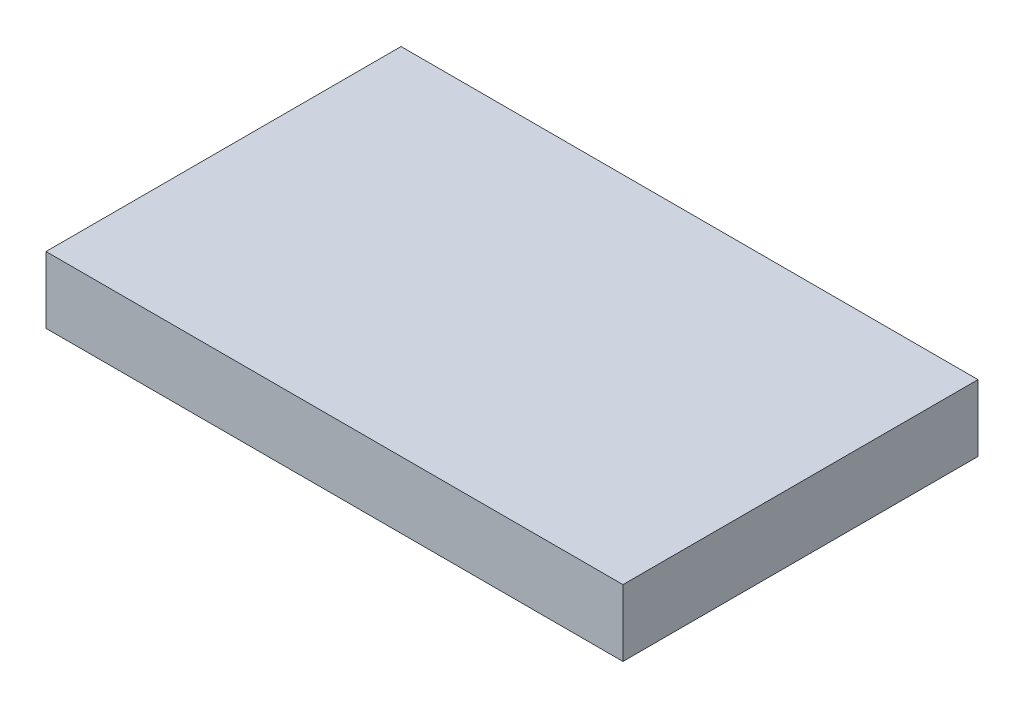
ISO-10303-21;
HEADER;
FILE_DESCRIPTION(('STEP AP214'),'2;1');
FILE_NAME('part.step','',(''),(''),'','','');
FILE_SCHEMA(('AUTOMOTIVE_DESIGN { 1 0 10303 214 1 1 1 1 }'));
ENDSEC;
DATA;
#1=APPLICATION_CONTEXT('core data for automotive mechanical design processes');
#2=APPLICATION_PROTOCOL_DEFINITION('international standard','automotive_design',2000,#1);
#3=PRODUCT_CONTEXT('',#1,'mechanical');
#4=PRODUCT('Part','Part','',(#3));
#5=PRODUCT_RELATED_PRODUCT_CATEGORY('part','',(#4));
#6=PRODUCT_DEFINITION_FORMATION('','',#4);
#7=PRODUCT_DEFINITION_CONTEXT('part definition',#1,'design');
#8=PRODUCT_DEFINITION('design','',#6,#7);
#9=PRODUCT_DEFINITION_SHAPE('','',#8);
#10=(LENGTH_UNIT() NAMED_UNIT(*) SI_UNIT(.MILLI.,.METRE.));
#11=(NAMED_UNIT(*) PLANE_ANGLE_UNIT() SI_UNIT($,.RADIAN.));
#12=(NAMED_UNIT(*) SI_UNIT($,.STERADIAN.) SOLID_ANGLE_UNIT());
#13=UNCERTAINTY_MEASURE_WITH_UNIT(LENGTH_MEASURE(1.E-05),#10,'distance_accuracy_value','');
#14=(GEOMETRIC_REPRESENTATION_CONTEXT(3) GLOBAL_UNCERTAINTY_ASSIGNED_CONTEXT((#13)) GLOBAL_UNIT_ASSIGNED_CONTEXT((#10,
#11,#12)) REPRESENTATION_CONTEXT('',''));
#15=CARTESIAN_POINT('',(0.,0.,0.));
#16=DIRECTION('',(0.,0.,1.));
#17=DIRECTION('',(1.,0.,0.));
#18=AXIS2_PLACEMENT_3D('',#15,#16,#17);
#19=CARTESIAN_POINT('',(165.1,19.05,101.6));
#20=DIRECTION('',(-1.,0.,0.));
#21=DIRECTION('',(0.,0.,1.));
#22=AXIS2_PLACEMENT_3D('',#19,#20,#21);
#23=PLANE('',#22);
#24=DIRECTION('',(0.,1.,0.));
#25=VECTOR('',#24,1.);
#26=CARTESIAN_POINT('',(165.1,19.05,0.));
#27=LINE('',#26,#25);
#28=CARTESIAN_POINT('',(165.1,0.,0.));
#29=VERTEX_POINT('',#28);
#30=CARTESIAN_POINT('',(165.1,19.05,0.));
#31=VERTEX_POINT('',#30);
#32=EDGE_CURVE('E95',#29,#31,#27,.T.);
#33=ORIENTED_EDGE('',*,*,#32,.T.);
#34=DIRECTION('',(0.,0.,-1.));
#35=VECTOR('',#34,1.);
#36=CARTESIAN_POINT('',(165.1,19.05,101.6));
#37=LINE('',#36,#35);
#38=CARTESIAN_POINT('',(165.1,19.05,101.6));
#39=VERTEX_POINT('',#38);
#40=EDGE_CURVE('E11',#39,#31,#37,.T.);
#41=ORIENTED_EDGE('',*,*,#40,.F.);
#42=DIRECTION('',(0.,1.,0.));
#43=VECTOR('',#42,1.);
#44=CARTESIAN_POINT('',(165.1,19.05,101.6));
#45=LINE('',#44,#43);
#46=CARTESIAN_POINT('',(165.1,0.,101.6));
#47=VERTEX_POINT('',#46);
#48=EDGE_CURVE('E83',#47,#39,#45,.T.);
#49=ORIENTED_EDGE('',*,*,#48,.F.);
#50=DIRECTION('',(0.,0.,-1.));
#51=VECTOR('',#50,1.);
#52=CARTESIAN_POINT('',(165.1,0.,101.6));
#53=LINE('',#52,#51);
#54=EDGE_CURVE('E91',#47,#29,#53,.T.);
#55=ORIENTED_EDGE('',*,*,#54,.T.);
#56=EDGE_LOOP('',(#33,#41,#49,#55));
#57=FACE_BOUND('',#56,.T.);
#58=ADVANCED_FACE('F32',(#57),#23,.F.);
#59=CARTESIAN_POINT('',(165.1,19.05,101.6));
#60=DIRECTION('',(0.,-1.,0.));
#61=DIRECTION('',(1.,0.,0.));
#62=AXIS2_PLACEMENT_3D('',#59,#60,#61);
#63=PLANE('',#62);
#64=DIRECTION('',(-1.,0.,0.));
#65=VECTOR('',#64,1.);
#66=CARTESIAN_POINT('',(165.1,19.05,0.));
#67=LINE('',#66,#65);
#68=CARTESIAN_POINT('',(0.,19.0499999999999,0.));
#69=VERTEX_POINT('',#68);
#70=EDGE_CURVE('E87',#31,#69,#67,.T.);
#71=ORIENTED_EDGE('',*,*,#70,.T.);
#72=DIRECTION('',(0.,0.,-1.));
#73=VECTOR('',#72,1.);
#74=CARTESIAN_POINT('',(0.,19.0499999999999,101.6));
#75=LINE('',#74,#73);
#76=CARTESIAN_POINT('',(0.,19.0499999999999,101.6));
#77=VERTEX_POINT('',#76);
#78=EDGE_CURVE('E40',#77,#69,#75,.T.);
#79=ORIENTED_EDGE('',*,*,#78,.F.);
#80=DIRECTION('',(-1.,0.,0.));
#81=VECTOR('',#80,1.);
#82=CARTESIAN_POINT('',(165.1,19.05,101.6));
#83=LINE('',#82,#81);
#84=EDGE_CURVE('E78',#39,#77,#83,.T.);
#85=ORIENTED_EDGE('',*,*,#84,.F.);
#86=ORIENTED_EDGE('',*,*,#40,.T.);
#87=EDGE_LOOP('',(#71,#79,#85,#86));
#88=FACE_BOUND('',#87,.T.);
#89=ADVANCED_FACE('F86',(#88),#63,.F.);
#90=CARTESIAN_POINT('',(0.,19.0499999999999,101.6));
#91=DIRECTION('',(1.,0.,0.));
#92=DIRECTION('',(0.,1.,0.));
#93=AXIS2_PLACEMENT_3D('',#90,#91,#92);
#94=PLANE('',#93);
#95=DIRECTION('',(0.,-1.,0.));
#96=VECTOR('',#95,1.);
#97=CARTESIAN_POINT('',(0.,19.0499999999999,0.));
#98=LINE('',#97,#96);
#99=CARTESIAN_POINT('',(0.,0.,0.));
#100=VERTEX_POINT('',#99);
#101=EDGE_CURVE('E65',#69,#100,#98,.T.);
#102=ORIENTED_EDGE('',*,*,#101,.T.);
#103=DIRECTION('',(0.,0.,-1.));
#104=VECTOR('',#103,1.);
#105=CARTESIAN_POINT('',(0.,0.,101.6));
#106=LINE('',#105,#104);
#107=CARTESIAN_POINT('',(0.,0.,101.6));
#108=VERTEX_POINT('',#107);
#109=EDGE_CURVE('E88',#108,#100,#106,.T.);
#110=ORIENTED_EDGE('',*,*,#109,.F.);
#111=DIRECTION('',(0.,-1.,0.));
#112=VECTOR('',#111,1.);
#113=CARTESIAN_POINT('',(0.,19.0499999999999,101.6));
#114=LINE('',#113,#112);
#115=EDGE_CURVE('E81',#77,#108,#114,.T.);
#116=ORIENTED_EDGE('',*,*,#115,.F.);
#117=ORIENTED_EDGE('',*,*,#78,.T.);
#118=EDGE_LOOP('',(#102,#110,#116,#117));
#119=FACE_BOUND('',#118,.T.);
#120=ADVANCED_FACE('F89',(#119),#94,.F.);
#121=CARTESIAN_POINT('',(165.1,0.,101.6));
#122=DIRECTION('',(0.,1.,0.));
#123=DIRECTION('',(-1.,0.,0.));
#124=AXIS2_PLACEMENT_3D('',#121,#122,#123);
#125=PLANE('',#124);
#126=DIRECTION('',(1.,0.,0.));
#127=VECTOR('',#126,1.);
#128=CARTESIAN_POINT('',(165.1,0.,0.));
#129=LINE('',#128,#127);
#130=EDGE_CURVE('E71',#100,#29,#129,.T.);
#131=ORIENTED_EDGE('',*,*,#130,.T.);
#132=ORIENTED_EDGE('',*,*,#54,.F.);
#133=DIRECTION('',(1.,0.,0.));
#134=VECTOR('',#133,1.);
#135=CARTESIAN_POINT('',(165.1,0.,101.6));
#136=LINE('',#135,#134);
#137=EDGE_CURVE('E48',#108,#47,#136,.T.);
#138=ORIENTED_EDGE('',*,*,#137,.F.);
#139=ORIENTED_EDGE('',*,*,#109,.T.);
#140=EDGE_LOOP('',(#131,#132,#138,#139));
#141=FACE_BOUND('',#140,.T.);
#142=ADVANCED_FACE('F102',(#141),#125,.F.);
#143=CARTESIAN_POINT('',(165.1,0.,101.6));
#144=DIRECTION('',(0.,0.,-1.));
#145=DIRECTION('',(-1.,0.,0.));
#146=AXIS2_PLACEMENT_3D('',#143,#144,#145);
#147=PLANE('',#146);
#148=ORIENTED_EDGE('',*,*,#48,.T.);
#149=ORIENTED_EDGE('',*,*,#84,.T.);
#150=ORIENTED_EDGE('',*,*,#115,.T.);
#151=ORIENTED_EDGE('',*,*,#137,.T.);
#152=EDGE_LOOP('',(#148,#149,#150,#151));
#153=FACE_BOUND('',#152,.T.);
#154=ADVANCED_FACE('F79',(#153),#147,.F.);
#155=CARTESIAN_POINT('',(165.1,0.,0.));
#156=DIRECTION('',(0.,0.,-1.));
#157=DIRECTION('',(-1.,0.,0.));
#158=AXIS2_PLACEMENT_3D('',#155,#156,#157);
#159=PLANE('',#158);
#160=ORIENTED_EDGE('',*,*,#32,.F.);
#161=ORIENTED_EDGE('',*,*,#130,.F.);
#162=ORIENTED_EDGE('',*,*,#101,.F.);
#163=ORIENTED_EDGE('',*,*,#70,.F.);
#164=EDGE_LOOP('',(#160,#161,#162,#163));
#165=FACE_BOUND('',#164,.T.);
#166=ADVANCED_FACE('F105',(#165),#159,.T.);
#167=CLOSED_SHELL('',(#58,#89,#120,#142,#154,#166));
#168=MANIFOLD_SOLID_BREP('B2',#167);
#169=ADVANCED_BREP_SHAPE_REPRESENTATION('',(#18,#168),#14);
#170=SHAPE_DEFINITION_REPRESENTATION(#9,#169);
ENDSEC;
END-ISO-10303-21;
